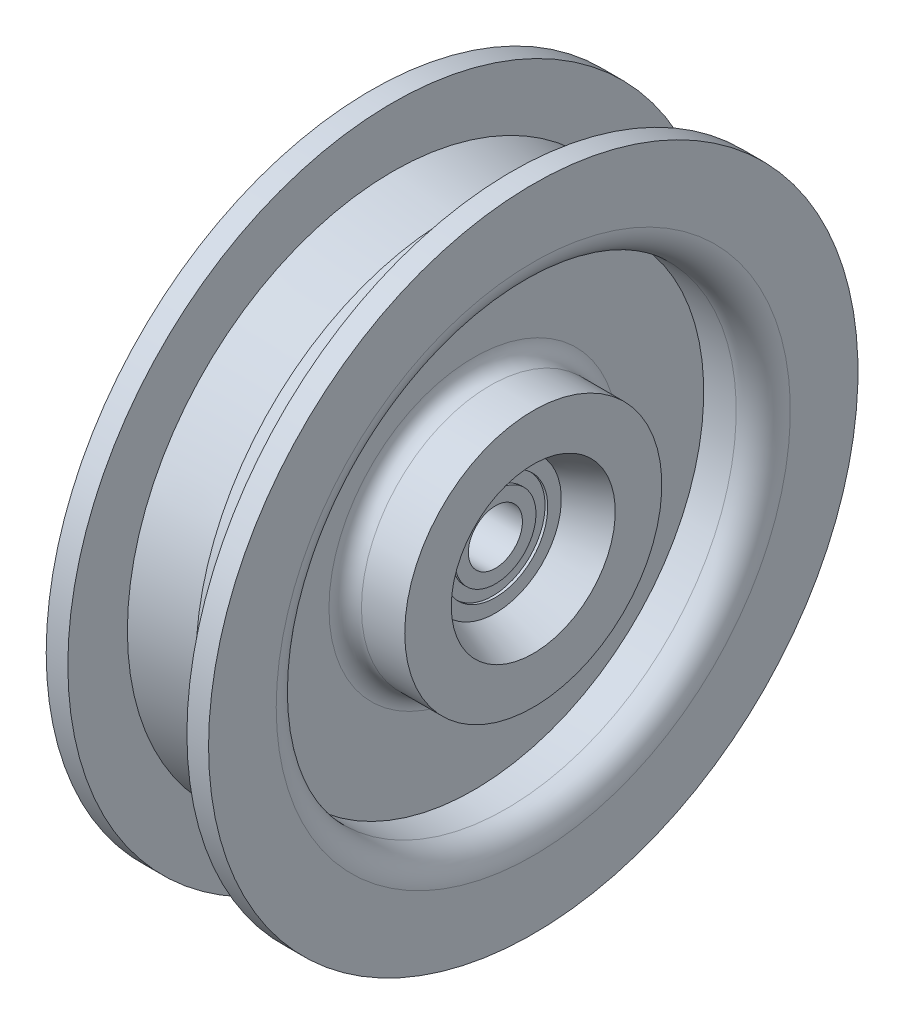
ISO-10303-21;
HEADER;
FILE_DESCRIPTION(('STEP AP214'),'2;1');
FILE_NAME('part.step','',(''),(''),'','','');
FILE_SCHEMA(('AUTOMOTIVE_DESIGN { 1 0 10303 214 1 1 1 1 }'));
ENDSEC;
DATA;
#1=APPLICATION_CONTEXT('core data for automotive mechanical design processes');
#2=APPLICATION_PROTOCOL_DEFINITION('international standard','automotive_design',2000,#1);
#3=PRODUCT_CONTEXT('',#1,'mechanical');
#4=PRODUCT('Part','Part','',(#3));
#5=PRODUCT_RELATED_PRODUCT_CATEGORY('part','',(#4));
#6=PRODUCT_DEFINITION_FORMATION('','',#4);
#7=PRODUCT_DEFINITION_CONTEXT('part definition',#1,'design');
#8=PRODUCT_DEFINITION('design','',#6,#7);
#9=PRODUCT_DEFINITION_SHAPE('','',#8);
#10=(LENGTH_UNIT() NAMED_UNIT(*) SI_UNIT(.MILLI.,.METRE.));
#11=(NAMED_UNIT(*) PLANE_ANGLE_UNIT() SI_UNIT($,.RADIAN.));
#12=(NAMED_UNIT(*) SI_UNIT($,.STERADIAN.) SOLID_ANGLE_UNIT());
#13=UNCERTAINTY_MEASURE_WITH_UNIT(LENGTH_MEASURE(1.E-05),#10,'distance_accuracy_value','');
#14=(GEOMETRIC_REPRESENTATION_CONTEXT(3) GLOBAL_UNCERTAINTY_ASSIGNED_CONTEXT((#13)) GLOBAL_UNIT_ASSIGNED_CONTEXT((#10,
#11,#12)) REPRESENTATION_CONTEXT('',''));
#15=CARTESIAN_POINT('',(0.,0.,0.));
#16=DIRECTION('',(0.,0.,1.));
#17=DIRECTION('',(1.,0.,0.));
#18=AXIS2_PLACEMENT_3D('',#15,#16,#17);
#19=CARTESIAN_POINT('',(-15.,-7.96024964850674,0.));
#20=DIRECTION('',(1.,0.,0.));
#21=DIRECTION('',(0.,0.,-1.));
#22=AXIS2_PLACEMENT_3D('',#19,#20,#21);
#23=PLANE('',#22);
#24=CARTESIAN_POINT('',(-15.,0.,0.));
#25=DIRECTION('',(-1.,0.,0.));
#26=DIRECTION('',(0.,0.,1.));
#27=AXIS2_PLACEMENT_3D('',#24,#25,#26);
#28=CIRCLE('',#27,47.5);
#29=CARTESIAN_POINT('',(-15.,0.,47.5));
#30=VERTEX_POINT('',#29);
#31=EDGE_CURVE('E10',#30,#30,#28,.T.);
#32=ORIENTED_EDGE('',*,*,#31,.F.);
#33=EDGE_LOOP('',(#32));
#34=FACE_BOUND('',#33,.T.);
#35=CARTESIAN_POINT('',(-15.,0.,0.));
#36=DIRECTION('',(-1.,0.,0.));
#37=DIRECTION('',(0.,0.,1.));
#38=AXIS2_PLACEMENT_3D('',#35,#36,#37);
#39=CIRCLE('',#38,60.);
#40=CARTESIAN_POINT('',(-15.,0.,60.));
#41=VERTEX_POINT('',#40);
#42=EDGE_CURVE('E105',#41,#41,#39,.T.);
#43=ORIENTED_EDGE('',*,*,#42,.T.);
#44=EDGE_LOOP('',(#43));
#45=FACE_BOUND('',#44,.T.);
#46=ADVANCED_FACE('F34',(#34,#45),#23,.F.);
#47=CARTESIAN_POINT('',(-10.,0.,0.));
#48=DIRECTION('',(-1.,0.,0.));
#49=DIRECTION('',(0.,0.,1.));
#50=AXIS2_PLACEMENT_3D('',#47,#48,#49);
#51=TOROIDAL_SURFACE('',#50,47.5,5.);
#52=CARTESIAN_POINT('',(-10.,0.,0.));
#53=DIRECTION('',(-1.,0.,0.));
#54=DIRECTION('',(0.,0.,1.));
#55=AXIS2_PLACEMENT_3D('',#52,#53,#54);
#56=CIRCLE('',#55,42.5);
#57=CARTESIAN_POINT('',(-10.,0.,42.5));
#58=VERTEX_POINT('',#57);
#59=EDGE_CURVE('E41',#58,#58,#56,.T.);
#60=ORIENTED_EDGE('',*,*,#59,.F.);
#61=EDGE_LOOP('',(#60));
#62=FACE_BOUND('',#61,.T.);
#63=ORIENTED_EDGE('',*,*,#31,.T.);
#64=EDGE_LOOP('',(#63));
#65=FACE_BOUND('',#64,.T.);
#66=ADVANCED_FACE('F168',(#62,#65),#51,.T.);
#67=CARTESIAN_POINT('',(0.,0.,0.));
#68=DIRECTION('',(-1.,0.,0.));
#69=DIRECTION('',(0.,0.,1.));
#70=AXIS2_PLACEMENT_3D('',#67,#68,#69);
#71=CYLINDRICAL_SURFACE('',#70,42.5);
#72=ORIENTED_EDGE('',*,*,#59,.T.);
#73=EDGE_LOOP('',(#72));
#74=FACE_BOUND('',#73,.T.);
#75=CARTESIAN_POINT('',(-4.,0.,0.));
#76=DIRECTION('',(-1.,0.,0.));
#77=DIRECTION('',(0.,0.,1.));
#78=AXIS2_PLACEMENT_3D('',#75,#76,#77);
#79=CIRCLE('',#78,42.5);
#80=CARTESIAN_POINT('',(-4.,0.,42.5));
#81=VERTEX_POINT('',#80);
#82=EDGE_CURVE('E45',#81,#81,#79,.T.);
#83=ORIENTED_EDGE('',*,*,#82,.F.);
#84=EDGE_LOOP('',(#83));
#85=FACE_BOUND('',#84,.T.);
#86=ADVANCED_FACE('F173',(#74,#85),#71,.F.);
#87=CARTESIAN_POINT('',(-4.,-7.96024964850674,0.));
#88=DIRECTION('',(1.,0.,0.));
#89=DIRECTION('',(0.,0.,-1.));
#90=AXIS2_PLACEMENT_3D('',#87,#88,#89);
#91=PLANE('',#90);
#92=CARTESIAN_POINT('',(-4.,0.,0.));
#93=DIRECTION('',(-1.,0.,0.));
#94=DIRECTION('',(0.,0.,1.));
#95=AXIS2_PLACEMENT_3D('',#92,#93,#94);
#96=CIRCLE('',#95,26.75);
#97=CARTESIAN_POINT('',(-4.,0.,26.75));
#98=VERTEX_POINT('',#97);
#99=EDGE_CURVE('E49',#98,#98,#96,.T.);
#100=ORIENTED_EDGE('',*,*,#99,.F.);
#101=EDGE_LOOP('',(#100));
#102=FACE_BOUND('',#101,.T.);
#103=ORIENTED_EDGE('',*,*,#82,.T.);
#104=EDGE_LOOP('',(#103));
#105=FACE_BOUND('',#104,.T.);
#106=ADVANCED_FACE('F259',(#102,#105),#91,.F.);
#107=CARTESIAN_POINT('',(-7.,0.,0.));
#108=DIRECTION('',(-1.,0.,0.));
#109=DIRECTION('',(0.,0.,1.));
#110=AXIS2_PLACEMENT_3D('',#107,#108,#109);
#111=TOROIDAL_SURFACE('',#110,26.75,3.);
#112=CARTESIAN_POINT('',(-7.,0.,0.));
#113=DIRECTION('',(-1.,0.,0.));
#114=DIRECTION('',(0.,0.,1.));
#115=AXIS2_PLACEMENT_3D('',#112,#113,#114);
#116=CIRCLE('',#115,23.75);
#117=CARTESIAN_POINT('',(-7.,0.,23.75));
#118=VERTEX_POINT('',#117);
#119=EDGE_CURVE('E54',#118,#118,#116,.T.);
#120=ORIENTED_EDGE('',*,*,#119,.F.);
#121=EDGE_LOOP('',(#120));
#122=FACE_BOUND('',#121,.T.);
#123=ORIENTED_EDGE('',*,*,#99,.T.);
#124=EDGE_LOOP('',(#123));
#125=FACE_BOUND('',#124,.T.);
#126=ADVANCED_FACE('F255',(#122,#125),#111,.F.);
#127=CARTESIAN_POINT('',(0.,0.,0.));
#128=DIRECTION('',(-1.,0.,0.));
#129=DIRECTION('',(0.,0.,1.));
#130=AXIS2_PLACEMENT_3D('',#127,#128,#129);
#131=CYLINDRICAL_SURFACE('',#130,23.75);
#132=CARTESIAN_POINT('',(-15.,0.,0.));
#133=DIRECTION('',(-1.,0.,0.));
#134=DIRECTION('',(0.,0.,1.));
#135=AXIS2_PLACEMENT_3D('',#132,#133,#134);
#136=CIRCLE('',#135,23.75);
#137=CARTESIAN_POINT('',(-15.,0.,23.75));
#138=VERTEX_POINT('',#137);
#139=EDGE_CURVE('E57',#138,#138,#136,.T.);
#140=ORIENTED_EDGE('',*,*,#139,.F.);
#141=EDGE_LOOP('',(#140));
#142=FACE_BOUND('',#141,.T.);
#143=ORIENTED_EDGE('',*,*,#119,.T.);
#144=EDGE_LOOP('',(#143));
#145=FACE_BOUND('',#144,.T.);
#146=ADVANCED_FACE('F251',(#142,#145),#131,.T.);
#147=CARTESIAN_POINT('',(-15.,-7.96024964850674,0.));
#148=DIRECTION('',(1.,0.,0.));
#149=DIRECTION('',(0.,0.,-1.));
#150=AXIS2_PLACEMENT_3D('',#147,#148,#149);
#151=PLANE('',#150);
#152=CARTESIAN_POINT('',(-15.,0.,0.));
#153=DIRECTION('',(-1.,0.,0.));
#154=DIRECTION('',(0.,0.,1.));
#155=AXIS2_PLACEMENT_3D('',#152,#153,#154);
#156=CIRCLE('',#155,15.15);
#157=CARTESIAN_POINT('',(-15.,0.,15.15));
#158=VERTEX_POINT('',#157);
#159=EDGE_CURVE('E60',#158,#158,#156,.T.);
#160=ORIENTED_EDGE('',*,*,#159,.F.);
#161=EDGE_LOOP('',(#160));
#162=FACE_BOUND('',#161,.T.);
#163=ORIENTED_EDGE('',*,*,#139,.T.);
#164=EDGE_LOOP('',(#163));
#165=FACE_BOUND('',#164,.T.);
#166=ADVANCED_FACE('F247',(#162,#165),#151,.F.);
#167=CARTESIAN_POINT('',(-8.,0.,0.));
#168=DIRECTION('',(-1.,0.,0.));
#169=DIRECTION('',(0.,0.,1.));
#170=AXIS2_PLACEMENT_3D('',#167,#168,#169);
#171=CONICAL_SURFACE('',#170,12.18,0.401265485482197);
#172=ORIENTED_EDGE('',*,*,#159,.T.);
#173=EDGE_LOOP('',(#172));
#174=FACE_BOUND('',#173,.T.);
#175=CARTESIAN_POINT('',(-8.,0.,0.));
#176=DIRECTION('',(-1.,0.,0.));
#177=DIRECTION('',(0.,0.,1.));
#178=AXIS2_PLACEMENT_3D('',#175,#176,#177);
#179=CIRCLE('',#178,12.18);
#180=CARTESIAN_POINT('',(-8.,0.,12.18));
#181=VERTEX_POINT('',#180);
#182=EDGE_CURVE('E63',#181,#181,#179,.T.);
#183=ORIENTED_EDGE('',*,*,#182,.F.);
#184=EDGE_LOOP('',(#183));
#185=FACE_BOUND('',#184,.T.);
#186=ADVANCED_FACE('F243',(#174,#185),#171,.F.);
#187=CARTESIAN_POINT('',(8.,0.,0.));
#188=DIRECTION('',(1.,0.,0.));
#189=DIRECTION('',(0.,0.,-1.));
#190=AXIS2_PLACEMENT_3D('',#187,#188,#189);
#191=CONICAL_SURFACE('',#190,12.18,0.401265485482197);
#192=CARTESIAN_POINT('',(15.,0.,0.));
#193=DIRECTION('',(-1.,0.,0.));
#194=DIRECTION('',(0.,0.,1.));
#195=AXIS2_PLACEMENT_3D('',#192,#193,#194);
#196=CIRCLE('',#195,15.15);
#197=CARTESIAN_POINT('',(15.,0.,15.15));
#198=VERTEX_POINT('',#197);
#199=EDGE_CURVE('E66',#198,#198,#196,.T.);
#200=ORIENTED_EDGE('',*,*,#199,.F.);
#201=EDGE_LOOP('',(#200));
#202=FACE_BOUND('',#201,.T.);
#203=CARTESIAN_POINT('',(8.,0.,0.));
#204=DIRECTION('',(-1.,0.,0.));
#205=DIRECTION('',(0.,0.,1.));
#206=AXIS2_PLACEMENT_3D('',#203,#204,#205);
#207=CIRCLE('',#206,12.18);
#208=CARTESIAN_POINT('',(8.,0.,12.18));
#209=VERTEX_POINT('',#208);
#210=EDGE_CURVE('E129',#209,#209,#207,.T.);
#211=ORIENTED_EDGE('',*,*,#210,.T.);
#212=EDGE_LOOP('',(#211));
#213=FACE_BOUND('',#212,.T.);
#214=ADVANCED_FACE('F239',(#202,#213),#191,.F.);
#215=CARTESIAN_POINT('',(15.,-7.96024964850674,0.));
#216=DIRECTION('',(1.,0.,0.));
#217=DIRECTION('',(0.,0.,-1.));
#218=AXIS2_PLACEMENT_3D('',#215,#216,#217);
#219=PLANE('',#218);
#220=ORIENTED_EDGE('',*,*,#199,.T.);
#221=EDGE_LOOP('',(#220));
#222=FACE_BOUND('',#221,.T.);
#223=CARTESIAN_POINT('',(15.,0.,0.));
#224=DIRECTION('',(-1.,0.,0.));
#225=DIRECTION('',(0.,0.,1.));
#226=AXIS2_PLACEMENT_3D('',#223,#224,#225);
#227=CIRCLE('',#226,23.75);
#228=CARTESIAN_POINT('',(15.,0.,23.75));
#229=VERTEX_POINT('',#228);
#230=EDGE_CURVE('E69',#229,#229,#227,.T.);
#231=ORIENTED_EDGE('',*,*,#230,.F.);
#232=EDGE_LOOP('',(#231));
#233=FACE_BOUND('',#232,.T.);
#234=ADVANCED_FACE('F235',(#222,#233),#219,.T.);
#235=CARTESIAN_POINT('',(0.,0.,0.));
#236=DIRECTION('',(-1.,0.,0.));
#237=DIRECTION('',(0.,0.,1.));
#238=AXIS2_PLACEMENT_3D('',#235,#236,#237);
#239=CYLINDRICAL_SURFACE('',#238,23.75);
#240=ORIENTED_EDGE('',*,*,#230,.T.);
#241=EDGE_LOOP('',(#240));
#242=FACE_BOUND('',#241,.T.);
#243=CARTESIAN_POINT('',(7.,0.,0.));
#244=DIRECTION('',(-1.,0.,0.));
#245=DIRECTION('',(0.,0.,1.));
#246=AXIS2_PLACEMENT_3D('',#243,#244,#245);
#247=CIRCLE('',#246,23.75);
#248=CARTESIAN_POINT('',(7.,0.,23.75));
#249=VERTEX_POINT('',#248);
#250=EDGE_CURVE('E72',#249,#249,#247,.T.);
#251=ORIENTED_EDGE('',*,*,#250,.F.);
#252=EDGE_LOOP('',(#251));
#253=FACE_BOUND('',#252,.T.);
#254=ADVANCED_FACE('F231',(#242,#253),#239,.T.);
#255=CARTESIAN_POINT('',(7.,0.,0.));
#256=DIRECTION('',(-1.,0.,0.));
#257=DIRECTION('',(0.,0.,1.));
#258=AXIS2_PLACEMENT_3D('',#255,#256,#257);
#259=TOROIDAL_SURFACE('',#258,26.75,3.);
#260=ORIENTED_EDGE('',*,*,#250,.T.);
#261=EDGE_LOOP('',(#260));
#262=FACE_BOUND('',#261,.T.);
#263=CARTESIAN_POINT('',(4.,0.,0.));
#264=DIRECTION('',(-1.,0.,0.));
#265=DIRECTION('',(0.,0.,1.));
#266=AXIS2_PLACEMENT_3D('',#263,#264,#265);
#267=CIRCLE('',#266,26.75);
#268=CARTESIAN_POINT('',(4.,0.,26.75));
#269=VERTEX_POINT('',#268);
#270=EDGE_CURVE('E75',#269,#269,#267,.T.);
#271=ORIENTED_EDGE('',*,*,#270,.F.);
#272=EDGE_LOOP('',(#271));
#273=FACE_BOUND('',#272,.T.);
#274=ADVANCED_FACE('F227',(#262,#273),#259,.F.);
#275=CARTESIAN_POINT('',(4.,-7.96024964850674,0.));
#276=DIRECTION('',(1.,0.,0.));
#277=DIRECTION('',(0.,0.,-1.));
#278=AXIS2_PLACEMENT_3D('',#275,#276,#277);
#279=PLANE('',#278);
#280=ORIENTED_EDGE('',*,*,#270,.T.);
#281=EDGE_LOOP('',(#280));
#282=FACE_BOUND('',#281,.T.);
#283=CARTESIAN_POINT('',(4.,0.,0.));
#284=DIRECTION('',(-1.,0.,0.));
#285=DIRECTION('',(0.,0.,1.));
#286=AXIS2_PLACEMENT_3D('',#283,#284,#285);
#287=CIRCLE('',#286,42.5);
#288=CARTESIAN_POINT('',(4.,0.,42.5));
#289=VERTEX_POINT('',#288);
#290=EDGE_CURVE('E78',#289,#289,#287,.T.);
#291=ORIENTED_EDGE('',*,*,#290,.F.);
#292=EDGE_LOOP('',(#291));
#293=FACE_BOUND('',#292,.T.);
#294=ADVANCED_FACE('F223',(#282,#293),#279,.T.);
#295=CARTESIAN_POINT('',(0.,0.,0.));
#296=DIRECTION('',(-1.,0.,0.));
#297=DIRECTION('',(0.,0.,1.));
#298=AXIS2_PLACEMENT_3D('',#295,#296,#297);
#299=CYLINDRICAL_SURFACE('',#298,42.5);
#300=CARTESIAN_POINT('',(10.,0.,0.));
#301=DIRECTION('',(-1.,0.,0.));
#302=DIRECTION('',(0.,0.,1.));
#303=AXIS2_PLACEMENT_3D('',#300,#301,#302);
#304=CIRCLE('',#303,42.5);
#305=CARTESIAN_POINT('',(10.,0.,42.5));
#306=VERTEX_POINT('',#305);
#307=EDGE_CURVE('E81',#306,#306,#304,.T.);
#308=ORIENTED_EDGE('',*,*,#307,.F.);
#309=EDGE_LOOP('',(#308));
#310=FACE_BOUND('',#309,.T.);
#311=ORIENTED_EDGE('',*,*,#290,.T.);
#312=EDGE_LOOP('',(#311));
#313=FACE_BOUND('',#312,.T.);
#314=ADVANCED_FACE('F219',(#310,#313),#299,.F.);
#315=CARTESIAN_POINT('',(10.,0.,0.));
#316=DIRECTION('',(-1.,0.,0.));
#317=DIRECTION('',(0.,0.,1.));
#318=AXIS2_PLACEMENT_3D('',#315,#316,#317);
#319=TOROIDAL_SURFACE('',#318,47.5,5.);
#320=ORIENTED_EDGE('',*,*,#307,.T.);
#321=EDGE_LOOP('',(#320));
#322=FACE_BOUND('',#321,.T.);
#323=CARTESIAN_POINT('',(15.,0.,0.));
#324=DIRECTION('',(-1.,0.,0.));
#325=DIRECTION('',(0.,0.,1.));
#326=AXIS2_PLACEMENT_3D('',#323,#324,#325);
#327=CIRCLE('',#326,47.5);
#328=CARTESIAN_POINT('',(15.,0.,47.5));
#329=VERTEX_POINT('',#328);
#330=EDGE_CURVE('E84',#329,#329,#327,.T.);
#331=ORIENTED_EDGE('',*,*,#330,.F.);
#332=EDGE_LOOP('',(#331));
#333=FACE_BOUND('',#332,.T.);
#334=ADVANCED_FACE('F215',(#322,#333),#319,.T.);
#335=CARTESIAN_POINT('',(15.,-7.96024964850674,0.));
#336=DIRECTION('',(1.,0.,0.));
#337=DIRECTION('',(0.,0.,-1.));
#338=AXIS2_PLACEMENT_3D('',#335,#336,#337);
#339=PLANE('',#338);
#340=ORIENTED_EDGE('',*,*,#330,.T.);
#341=EDGE_LOOP('',(#340));
#342=FACE_BOUND('',#341,.T.);
#343=CARTESIAN_POINT('',(15.,0.,0.));
#344=DIRECTION('',(-1.,0.,0.));
#345=DIRECTION('',(0.,0.,1.));
#346=AXIS2_PLACEMENT_3D('',#343,#344,#345);
#347=CIRCLE('',#346,60.);
#348=CARTESIAN_POINT('',(15.,0.,60.));
#349=VERTEX_POINT('',#348);
#350=EDGE_CURVE('E87',#349,#349,#347,.T.);
#351=ORIENTED_EDGE('',*,*,#350,.F.);
#352=EDGE_LOOP('',(#351));
#353=FACE_BOUND('',#352,.T.);
#354=ADVANCED_FACE('F211',(#342,#353),#339,.T.);
#355=CARTESIAN_POINT('',(0.,0.,0.));
#356=DIRECTION('',(-1.,0.,0.));
#357=DIRECTION('',(0.,0.,1.));
#358=AXIS2_PLACEMENT_3D('',#355,#356,#357);
#359=CYLINDRICAL_SURFACE('',#358,60.);
#360=ORIENTED_EDGE('',*,*,#350,.T.);
#361=EDGE_LOOP('',(#360));
#362=FACE_BOUND('',#361,.T.);
#363=CARTESIAN_POINT('',(11.,0.,0.));
#364=DIRECTION('',(-1.,0.,0.));
#365=DIRECTION('',(0.,0.,1.));
#366=AXIS2_PLACEMENT_3D('',#363,#364,#365);
#367=CIRCLE('',#366,60.);
#368=CARTESIAN_POINT('',(11.,0.,60.));
#369=VERTEX_POINT('',#368);
#370=EDGE_CURVE('E90',#369,#369,#367,.T.);
#371=ORIENTED_EDGE('',*,*,#370,.F.);
#372=EDGE_LOOP('',(#371));
#373=FACE_BOUND('',#372,.T.);
#374=ADVANCED_FACE('F205',(#362,#373),#359,.T.);
#375=CARTESIAN_POINT('',(11.,-7.96024964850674,0.));
#376=DIRECTION('',(-1.,0.,0.));
#377=DIRECTION('',(0.,0.,1.));
#378=AXIS2_PLACEMENT_3D('',#375,#376,#377);
#379=PLANE('',#378);
#380=ORIENTED_EDGE('',*,*,#370,.T.);
#381=EDGE_LOOP('',(#380));
#382=FACE_BOUND('',#381,.T.);
#383=CARTESIAN_POINT('',(11.,0.,0.));
#384=DIRECTION('',(-1.,0.,0.));
#385=DIRECTION('',(0.,0.,1.));
#386=AXIS2_PLACEMENT_3D('',#383,#384,#385);
#387=CIRCLE('',#386,49.);
#388=CARTESIAN_POINT('',(11.,0.,49.));
#389=VERTEX_POINT('',#388);
#390=EDGE_CURVE('E93',#389,#389,#387,.T.);
#391=ORIENTED_EDGE('',*,*,#390,.F.);
#392=EDGE_LOOP('',(#391));
#393=FACE_BOUND('',#392,.T.);
#394=ADVANCED_FACE('F199',(#382,#393),#379,.T.);
#395=CARTESIAN_POINT('',(0.,0.,0.));
#396=DIRECTION('',(1.,0.,0.));
#397=DIRECTION('',(0.,0.,-1.));
#398=AXIS2_PLACEMENT_3D('',#395,#396,#397);
#399=CONICAL_SURFACE('',#398,47.33,0.150667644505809);
#400=ORIENTED_EDGE('',*,*,#390,.T.);
#401=EDGE_LOOP('',(#400));
#402=FACE_BOUND('',#401,.T.);
#403=CARTESIAN_POINT('',(0.,0.,0.));
#404=DIRECTION('',(-1.,0.,0.));
#405=DIRECTION('',(0.,0.,1.));
#406=AXIS2_PLACEMENT_3D('',#403,#404,#405);
#407=CIRCLE('',#406,47.33);
#408=CARTESIAN_POINT('',(0.,0.,47.33));
#409=VERTEX_POINT('',#408);
#410=EDGE_CURVE('E96',#409,#409,#407,.T.);
#411=ORIENTED_EDGE('',*,*,#410,.F.);
#412=EDGE_LOOP('',(#411));
#413=FACE_BOUND('',#412,.T.);
#414=ADVANCED_FACE('F194',(#402,#413),#399,.T.);
#415=CARTESIAN_POINT('',(0.,0.,0.));
#416=DIRECTION('',(-1.,0.,0.));
#417=DIRECTION('',(0.,0.,1.));
#418=AXIS2_PLACEMENT_3D('',#415,#416,#417);
#419=CONICAL_SURFACE('',#418,47.33,0.15066764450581);
#420=CARTESIAN_POINT('',(-11.,0.,0.));
#421=DIRECTION('',(-1.,0.,0.));
#422=DIRECTION('',(0.,0.,1.));
#423=AXIS2_PLACEMENT_3D('',#420,#421,#422);
#424=CIRCLE('',#423,49.);
#425=CARTESIAN_POINT('',(-11.,0.,49.));
#426=VERTEX_POINT('',#425);
#427=EDGE_CURVE('E99',#426,#426,#424,.T.);
#428=ORIENTED_EDGE('',*,*,#427,.F.);
#429=EDGE_LOOP('',(#428));
#430=FACE_BOUND('',#429,.T.);
#431=ORIENTED_EDGE('',*,*,#410,.T.);
#432=EDGE_LOOP('',(#431));
#433=FACE_BOUND('',#432,.T.);
#434=ADVANCED_FACE('F188',(#430,#433),#419,.T.);
#435=CARTESIAN_POINT('',(-11.,-7.96024964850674,0.));
#436=DIRECTION('',(-1.,0.,0.));
#437=DIRECTION('',(0.,0.,1.));
#438=AXIS2_PLACEMENT_3D('',#435,#436,#437);
#439=PLANE('',#438);
#440=CARTESIAN_POINT('',(-11.,0.,0.));
#441=DIRECTION('',(-1.,0.,0.));
#442=DIRECTION('',(0.,0.,1.));
#443=AXIS2_PLACEMENT_3D('',#440,#441,#442);
#444=CIRCLE('',#443,60.);
#445=CARTESIAN_POINT('',(-11.,0.,60.));
#446=VERTEX_POINT('',#445);
#447=EDGE_CURVE('E102',#446,#446,#444,.T.);
#448=ORIENTED_EDGE('',*,*,#447,.F.);
#449=EDGE_LOOP('',(#448));
#450=FACE_BOUND('',#449,.T.);
#451=ORIENTED_EDGE('',*,*,#427,.T.);
#452=EDGE_LOOP('',(#451));
#453=FACE_BOUND('',#452,.T.);
#454=ADVANCED_FACE('F182',(#450,#453),#439,.F.);
#455=CARTESIAN_POINT('',(0.,0.,0.));
#456=DIRECTION('',(-1.,0.,0.));
#457=DIRECTION('',(0.,0.,1.));
#458=AXIS2_PLACEMENT_3D('',#455,#456,#457);
#459=CYLINDRICAL_SURFACE('',#458,60.);
#460=ORIENTED_EDGE('',*,*,#42,.F.);
#461=EDGE_LOOP('',(#460));
#462=FACE_BOUND('',#461,.T.);
#463=ORIENTED_EDGE('',*,*,#447,.T.);
#464=EDGE_LOOP('',(#463));
#465=FACE_BOUND('',#464,.T.);
#466=ADVANCED_FACE('F178',(#462,#465),#459,.T.);
#467=CARTESIAN_POINT('',(0.,0.,0.));
#468=DIRECTION('',(-1.,0.,0.));
#469=DIRECTION('',(0.,0.,1.));
#470=AXIS2_PLACEMENT_3D('',#467,#468,#469);
#471=CYLINDRICAL_SURFACE('',#470,5.);
#472=CARTESIAN_POINT('',(8.,0.,0.));
#473=DIRECTION('',(-1.,0.,0.));
#474=DIRECTION('',(0.,0.,1.));
#475=AXIS2_PLACEMENT_3D('',#472,#473,#474);
#476=CIRCLE('',#475,5.);
#477=CARTESIAN_POINT('',(8.,0.,5.));
#478=VERTEX_POINT('',#477);
#479=EDGE_CURVE('E114',#478,#478,#476,.T.);
#480=ORIENTED_EDGE('',*,*,#479,.F.);
#481=EDGE_LOOP('',(#480));
#482=FACE_BOUND('',#481,.T.);
#483=CARTESIAN_POINT('',(-8.,0.,0.));
#484=DIRECTION('',(-1.,0.,0.));
#485=DIRECTION('',(0.,0.,1.));
#486=AXIS2_PLACEMENT_3D('',#483,#484,#485);
#487=CIRCLE('',#486,5.);
#488=CARTESIAN_POINT('',(-8.,0.,5.));
#489=VERTEX_POINT('',#488);
#490=EDGE_CURVE('E138',#489,#489,#487,.T.);
#491=ORIENTED_EDGE('',*,*,#490,.T.);
#492=EDGE_LOOP('',(#491));
#493=FACE_BOUND('',#492,.T.);
#494=ADVANCED_FACE('F181',(#482,#493),#471,.F.);
#495=CARTESIAN_POINT('',(8.,7.5,0.));
#496=DIRECTION('',(-1.,0.,0.));
#497=DIRECTION('',(0.,0.,1.));
#498=AXIS2_PLACEMENT_3D('',#495,#496,#497);
#499=PLANE('',#498);
#500=CARTESIAN_POINT('',(8.,0.,0.));
#501=DIRECTION('',(-1.,0.,0.));
#502=DIRECTION('',(0.,0.,1.));
#503=AXIS2_PLACEMENT_3D('',#500,#501,#502);
#504=CIRCLE('',#503,7.5);
#505=CARTESIAN_POINT('',(8.,0.,7.5));
#506=VERTEX_POINT('',#505);
#507=EDGE_CURVE('E117',#506,#506,#504,.T.);
#508=ORIENTED_EDGE('',*,*,#507,.F.);
#509=EDGE_LOOP('',(#508));
#510=FACE_BOUND('',#509,.T.);
#511=ORIENTED_EDGE('',*,*,#479,.T.);
#512=EDGE_LOOP('',(#511));
#513=FACE_BOUND('',#512,.T.);
#514=ADVANCED_FACE('F376',(#510,#513),#499,.F.);
#515=CARTESIAN_POINT('',(0.,0.,0.));
#516=DIRECTION('',(-1.,0.,0.));
#517=DIRECTION('',(0.,0.,1.));
#518=AXIS2_PLACEMENT_3D('',#515,#516,#517);
#519=CYLINDRICAL_SURFACE('',#518,7.5);
#520=CARTESIAN_POINT('',(7.5,0.,0.));
#521=DIRECTION('',(-1.,0.,0.));
#522=DIRECTION('',(0.,0.,1.));
#523=AXIS2_PLACEMENT_3D('',#520,#521,#522);
#524=CIRCLE('',#523,7.5);
#525=CARTESIAN_POINT('',(7.5,0.,7.5));
#526=VERTEX_POINT('',#525);
#527=EDGE_CURVE('E120',#526,#526,#524,.T.);
#528=ORIENTED_EDGE('',*,*,#527,.F.);
#529=EDGE_LOOP('',(#528));
#530=FACE_BOUND('',#529,.T.);
#531=ORIENTED_EDGE('',*,*,#507,.T.);
#532=EDGE_LOOP('',(#531));
#533=FACE_BOUND('',#532,.T.);
#534=ADVANCED_FACE('F381',(#530,#533),#519,.T.);
#535=CARTESIAN_POINT('',(7.5,9.68,0.));
#536=DIRECTION('',(-1.,0.,0.));
#537=DIRECTION('',(0.,0.,1.));
#538=AXIS2_PLACEMENT_3D('',#535,#536,#537);
#539=PLANE('',#538);
#540=CARTESIAN_POINT('',(7.5,0.,0.));
#541=DIRECTION('',(-1.,0.,0.));
#542=DIRECTION('',(0.,0.,1.));
#543=AXIS2_PLACEMENT_3D('',#540,#541,#542);
#544=CIRCLE('',#543,9.68);
#545=CARTESIAN_POINT('',(7.5,0.,9.68));
#546=VERTEX_POINT('',#545);
#547=EDGE_CURVE('E123',#546,#546,#544,.T.);
#548=ORIENTED_EDGE('',*,*,#547,.F.);
#549=EDGE_LOOP('',(#548));
#550=FACE_BOUND('',#549,.T.);
#551=ORIENTED_EDGE('',*,*,#527,.T.);
#552=EDGE_LOOP('',(#551));
#553=FACE_BOUND('',#552,.T.);
#554=ADVANCED_FACE('F392',(#550,#553),#539,.F.);
#555=CARTESIAN_POINT('',(0.,0.,0.));
#556=DIRECTION('',(-1.,0.,0.));
#557=DIRECTION('',(0.,0.,1.));
#558=AXIS2_PLACEMENT_3D('',#555,#556,#557);
#559=CYLINDRICAL_SURFACE('',#558,9.68);
#560=CARTESIAN_POINT('',(8.,0.,0.));
#561=DIRECTION('',(-1.,0.,0.));
#562=DIRECTION('',(0.,0.,1.));
#563=AXIS2_PLACEMENT_3D('',#560,#561,#562);
#564=CIRCLE('',#563,9.68);
#565=CARTESIAN_POINT('',(8.,0.,9.68));
#566=VERTEX_POINT('',#565);
#567=EDGE_CURVE('E126',#566,#566,#564,.T.);
#568=ORIENTED_EDGE('',*,*,#567,.F.);
#569=EDGE_LOOP('',(#568));
#570=FACE_BOUND('',#569,.T.);
#571=ORIENTED_EDGE('',*,*,#547,.T.);
#572=EDGE_LOOP('',(#571));
#573=FACE_BOUND('',#572,.T.);
#574=ADVANCED_FACE('F402',(#570,#573),#559,.F.);
#575=CARTESIAN_POINT('',(8.,12.18,0.));
#576=DIRECTION('',(-1.,0.,0.));
#577=DIRECTION('',(0.,0.,1.));
#578=AXIS2_PLACEMENT_3D('',#575,#576,#577);
#579=PLANE('',#578);
#580=ORIENTED_EDGE('',*,*,#210,.F.);
#581=EDGE_LOOP('',(#580));
#582=FACE_BOUND('',#581,.T.);
#583=ORIENTED_EDGE('',*,*,#567,.T.);
#584=EDGE_LOOP('',(#583));
#585=FACE_BOUND('',#584,.T.);
#586=ADVANCED_FACE('F412',(#582,#585),#579,.F.);
#587=CARTESIAN_POINT('',(-8.,7.5,0.));
#588=DIRECTION('',(1.,0.,0.));
#589=DIRECTION('',(0.,0.,1.));
#590=AXIS2_PLACEMENT_3D('',#587,#588,#589);
#591=PLANE('',#590);
#592=CARTESIAN_POINT('',(-8.,0.,0.));
#593=DIRECTION('',(-1.,0.,0.));
#594=DIRECTION('',(0.,0.,1.));
#595=AXIS2_PLACEMENT_3D('',#592,#593,#594);
#596=CIRCLE('',#595,7.5);
#597=CARTESIAN_POINT('',(-8.,0.,7.5));
#598=VERTEX_POINT('',#597);
#599=EDGE_CURVE('E141',#598,#598,#596,.T.);
#600=ORIENTED_EDGE('',*,*,#599,.T.);
#601=EDGE_LOOP('',(#600));
#602=FACE_BOUND('',#601,.T.);
#603=ORIENTED_EDGE('',*,*,#490,.F.);
#604=EDGE_LOOP('',(#603));
#605=FACE_BOUND('',#604,.T.);
#606=ADVANCED_FACE('F422',(#602,#605),#591,.F.);
#607=CARTESIAN_POINT('',(0.,0.,0.));
#608=DIRECTION('',(1.,0.,0.));
#609=DIRECTION('',(0.,0.,1.));
#610=AXIS2_PLACEMENT_3D('',#607,#608,#609);
#611=CYLINDRICAL_SURFACE('',#610,7.5);
#612=CARTESIAN_POINT('',(-7.5,0.,0.));
#613=DIRECTION('',(-1.,0.,0.));
#614=DIRECTION('',(0.,0.,1.));
#615=AXIS2_PLACEMENT_3D('',#612,#613,#614);
#616=CIRCLE('',#615,7.5);
#617=CARTESIAN_POINT('',(-7.5,0.,7.5));
#618=VERTEX_POINT('',#617);
#619=EDGE_CURVE('E144',#618,#618,#616,.T.);
#620=ORIENTED_EDGE('',*,*,#619,.T.);
#621=EDGE_LOOP('',(#620));
#622=FACE_BOUND('',#621,.T.);
#623=ORIENTED_EDGE('',*,*,#599,.F.);
#624=EDGE_LOOP('',(#623));
#625=FACE_BOUND('',#624,.T.);
#626=ADVANCED_FACE('F441',(#622,#625),#611,.T.);
#627=CARTESIAN_POINT('',(-7.5,9.68,0.));
#628=DIRECTION('',(1.,0.,0.));
#629=DIRECTION('',(0.,0.,1.));
#630=AXIS2_PLACEMENT_3D('',#627,#628,#629);
#631=PLANE('',#630);
#632=CARTESIAN_POINT('',(-7.5,0.,0.));
#633=DIRECTION('',(-1.,0.,0.));
#634=DIRECTION('',(0.,0.,1.));
#635=AXIS2_PLACEMENT_3D('',#632,#633,#634);
#636=CIRCLE('',#635,9.68);
#637=CARTESIAN_POINT('',(-7.5,0.,9.68));
#638=VERTEX_POINT('',#637);
#639=EDGE_CURVE('E147',#638,#638,#636,.T.);
#640=ORIENTED_EDGE('',*,*,#639,.T.);
#641=EDGE_LOOP('',(#640));
#642=FACE_BOUND('',#641,.T.);
#643=ORIENTED_EDGE('',*,*,#619,.F.);
#644=EDGE_LOOP('',(#643));
#645=FACE_BOUND('',#644,.T.);
#646=ADVANCED_FACE('F165',(#642,#645),#631,.F.);
#647=CARTESIAN_POINT('',(0.,0.,0.));
#648=DIRECTION('',(1.,0.,0.));
#649=DIRECTION('',(0.,0.,1.));
#650=AXIS2_PLACEMENT_3D('',#647,#648,#649);
#651=CYLINDRICAL_SURFACE('',#650,9.68);
#652=CARTESIAN_POINT('',(-8.,0.,0.));
#653=DIRECTION('',(-1.,0.,0.));
#654=DIRECTION('',(0.,0.,1.));
#655=AXIS2_PLACEMENT_3D('',#652,#653,#654);
#656=CIRCLE('',#655,9.68);
#657=CARTESIAN_POINT('',(-8.,0.,9.68));
#658=VERTEX_POINT('',#657);
#659=EDGE_CURVE('E150',#658,#658,#656,.T.);
#660=ORIENTED_EDGE('',*,*,#659,.T.);
#661=EDGE_LOOP('',(#660));
#662=FACE_BOUND('',#661,.T.);
#663=ORIENTED_EDGE('',*,*,#639,.F.);
#664=EDGE_LOOP('',(#663));
#665=FACE_BOUND('',#664,.T.);
#666=ADVANCED_FACE('F154',(#662,#665),#651,.F.);
#667=CARTESIAN_POINT('',(-8.,12.18,0.));
#668=DIRECTION('',(1.,0.,0.));
#669=DIRECTION('',(0.,0.,1.));
#670=AXIS2_PLACEMENT_3D('',#667,#668,#669);
#671=PLANE('',#670);
#672=ORIENTED_EDGE('',*,*,#182,.T.);
#673=EDGE_LOOP('',(#672));
#674=FACE_BOUND('',#673,.T.);
#675=ORIENTED_EDGE('',*,*,#659,.F.);
#676=EDGE_LOOP('',(#675));
#677=FACE_BOUND('',#676,.T.);
#678=ADVANCED_FACE('F157',(#674,#677),#671,.F.);
#679=CLOSED_SHELL('',(#46,#66,#86,#106,#126,#146,#166,#186,#214,#234,#254,#274,#294,#314,#334,
#354,#374,#394,#414,#434,#454,#466,#494,#514,#534,#554,#574,#586,#606,#626,#646,#666,#678));
#680=CARTESIAN_POINT('',(0.,0.,0.));
#681=DIRECTION('',(-1.,0.,0.));
#682=DIRECTION('',(0.,0.,1.));
#683=AXIS2_PLACEMENT_3D('',#680,#681,#682);
#684=CYLINDRICAL_SURFACE('',#683,7.5);
#685=CARTESIAN_POINT('',(0.500000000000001,0.,0.));
#686=DIRECTION('',(-1.,0.,0.));
#687=DIRECTION('',(0.,0.,1.));
#688=AXIS2_PLACEMENT_3D('',#685,#686,#687);
#689=CIRCLE('',#688,7.5);
#690=CARTESIAN_POINT('',(0.500000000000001,0.,7.5));
#691=VERTEX_POINT('',#690);
#692=EDGE_CURVE('E111',#691,#691,#689,.T.);
#693=ORIENTED_EDGE('',*,*,#692,.T.);
#694=EDGE_LOOP('',(#693));
#695=FACE_BOUND('',#694,.T.);
#696=CARTESIAN_POINT('',(-0.500000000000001,0.,0.));
#697=DIRECTION('',(-1.,0.,0.));
#698=DIRECTION('',(0.,0.,1.));
#699=AXIS2_PLACEMENT_3D('',#696,#697,#698);
#700=CIRCLE('',#699,7.5);
#701=CARTESIAN_POINT('',(-0.500000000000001,0.,7.5));
#702=VERTEX_POINT('',#701);
#703=EDGE_CURVE('E135',#702,#702,#700,.T.);
#704=ORIENTED_EDGE('',*,*,#703,.F.);
#705=EDGE_LOOP('',(#704));
#706=FACE_BOUND('',#705,.T.);
#707=ADVANCED_FACE('F367',(#695,#706),#684,.T.);
#708=CARTESIAN_POINT('',(0.500000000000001,9.68,0.));
#709=DIRECTION('',(1.,0.,0.));
#710=DIRECTION('',(0.,0.,-1.));
#711=AXIS2_PLACEMENT_3D('',#708,#709,#710);
#712=PLANE('',#711);
#713=ORIENTED_EDGE('',*,*,#692,.F.);
#714=EDGE_LOOP('',(#713));
#715=FACE_BOUND('',#714,.T.);
#716=CARTESIAN_POINT('',(0.5,0.,0.));
#717=DIRECTION('',(-1.,0.,0.));
#718=DIRECTION('',(0.,0.,1.));
#719=AXIS2_PLACEMENT_3D('',#716,#717,#718);
#720=CIRCLE('',#719,9.68);
#721=CARTESIAN_POINT('',(0.5,0.,9.68));
#722=VERTEX_POINT('',#721);
#723=EDGE_CURVE('E108',#722,#722,#720,.T.);
#724=ORIENTED_EDGE('',*,*,#723,.T.);
#725=EDGE_LOOP('',(#724));
#726=FACE_BOUND('',#725,.T.);
#727=ADVANCED_FACE('F361',(#715,#726),#712,.F.);
#728=CARTESIAN_POINT('',(0.,0.,0.));
#729=DIRECTION('',(-1.,0.,0.));
#730=DIRECTION('',(0.,0.,1.));
#731=AXIS2_PLACEMENT_3D('',#728,#729,#730);
#732=CYLINDRICAL_SURFACE('',#731,9.68);
#733=ORIENTED_EDGE('',*,*,#723,.F.);
#734=EDGE_LOOP('',(#733));
#735=FACE_BOUND('',#734,.T.);
#736=CARTESIAN_POINT('',(-0.5,0.,0.));
#737=DIRECTION('',(-1.,0.,0.));
#738=DIRECTION('',(0.,0.,1.));
#739=AXIS2_PLACEMENT_3D('',#736,#737,#738);
#740=CIRCLE('',#739,9.68);
#741=CARTESIAN_POINT('',(-0.5,0.,9.68));
#742=VERTEX_POINT('',#741);
#743=EDGE_CURVE('E132',#742,#742,#740,.T.);
#744=ORIENTED_EDGE('',*,*,#743,.T.);
#745=EDGE_LOOP('',(#744));
#746=FACE_BOUND('',#745,.T.);
#747=ADVANCED_FACE('F366',(#735,#746),#732,.F.);
#748=CARTESIAN_POINT('',(-0.500000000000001,9.68,0.));
#749=DIRECTION('',(-1.,0.,0.));
#750=DIRECTION('',(0.,0.,-1.));
#751=AXIS2_PLACEMENT_3D('',#748,#749,#750);
#752=PLANE('',#751);
#753=ORIENTED_EDGE('',*,*,#703,.T.);
#754=EDGE_LOOP('',(#753));
#755=FACE_BOUND('',#754,.T.);
#756=ORIENTED_EDGE('',*,*,#743,.F.);
#757=EDGE_LOOP('',(#756));
#758=FACE_BOUND('',#757,.T.);
#759=ADVANCED_FACE('F492',(#755,#758),#752,.F.);
#760=CLOSED_SHELL('',(#707,#727,#747,#759));
#761=ORIENTED_CLOSED_SHELL('',*,#760,.T.);
#762=BREP_WITH_VOIDS('B2',#679,(#761));
#763=ADVANCED_BREP_SHAPE_REPRESENTATION('',(#18,#762),#14);
#764=SHAPE_DEFINITION_REPRESENTATION(#9,#763);
ENDSEC;
END-ISO-10303-21;
